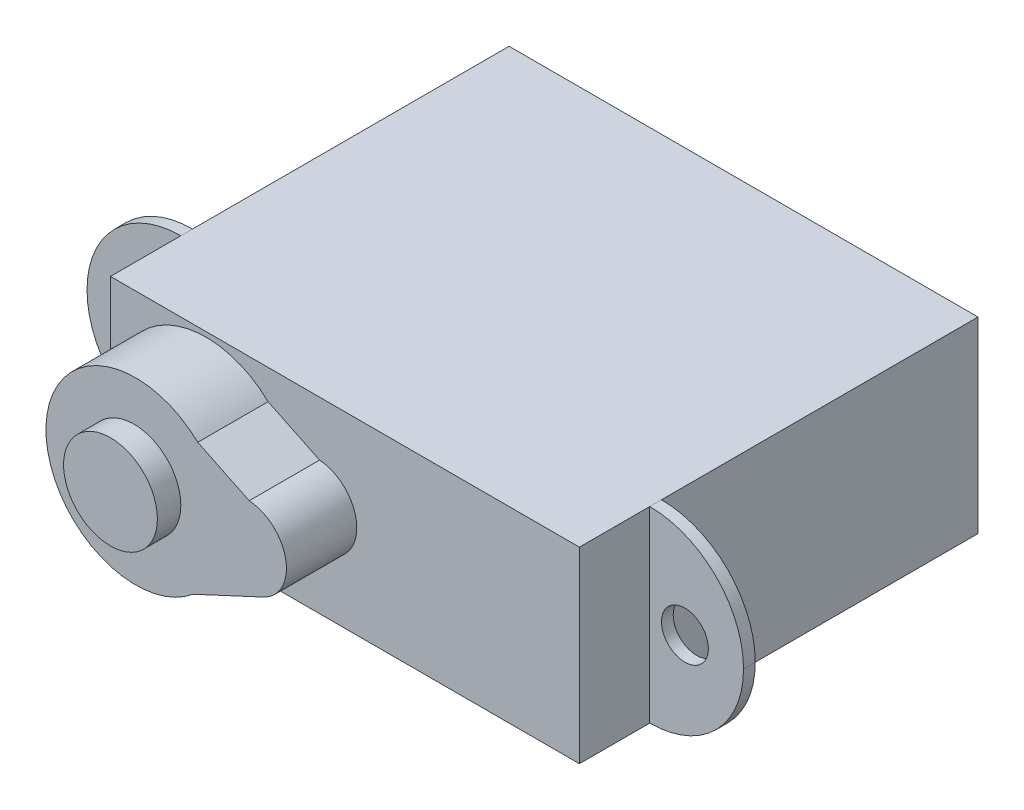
ISO-10303-21;
HEADER;
FILE_DESCRIPTION(('STEP AP214'),'2;1');
FILE_NAME('part.step','',(''),(''),'','','');
FILE_SCHEMA(('AUTOMOTIVE_DESIGN { 1 0 10303 214 1 1 1 1 }'));
ENDSEC;
DATA;
#1=APPLICATION_CONTEXT('core data for automotive mechanical design processes');
#2=APPLICATION_PROTOCOL_DEFINITION('international standard','automotive_design',2000,#1);
#3=PRODUCT_CONTEXT('',#1,'mechanical');
#4=PRODUCT('Part','Part','',(#3));
#5=PRODUCT_RELATED_PRODUCT_CATEGORY('part','',(#4));
#6=PRODUCT_DEFINITION_FORMATION('','',#4);
#7=PRODUCT_DEFINITION_CONTEXT('part definition',#1,'design');
#8=PRODUCT_DEFINITION('design','',#6,#7);
#9=PRODUCT_DEFINITION_SHAPE('','',#8);
#10=(LENGTH_UNIT() NAMED_UNIT(*) SI_UNIT(.MILLI.,.METRE.));
#11=(NAMED_UNIT(*) PLANE_ANGLE_UNIT() SI_UNIT($,.RADIAN.));
#12=(NAMED_UNIT(*) SI_UNIT($,.STERADIAN.) SOLID_ANGLE_UNIT());
#13=UNCERTAINTY_MEASURE_WITH_UNIT(LENGTH_MEASURE(1.E-05),#10,'distance_accuracy_value','');
#14=(GEOMETRIC_REPRESENTATION_CONTEXT(3) GLOBAL_UNCERTAINTY_ASSIGNED_CONTEXT((#13)) GLOBAL_UNIT_ASSIGNED_CONTEXT((#10,
#11,#12)) REPRESENTATION_CONTEXT('',''));
#15=CARTESIAN_POINT('',(0.,0.,0.));
#16=DIRECTION('',(0.,0.,1.));
#17=DIRECTION('',(1.,0.,0.));
#18=AXIS2_PLACEMENT_3D('',#15,#16,#17);
#19=CARTESIAN_POINT('',(-6.61728395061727,5.28395061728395,17.));
#20=DIRECTION('',(1.,0.,0.));
#21=DIRECTION('',(0.,0.,-1.));
#22=AXIS2_PLACEMENT_3D('',#19,#20,#21);
#23=PLANE('',#22);
#24=DIRECTION('',(0.,0.,-1.));
#25=VECTOR('',#24,1.);
#26=CARTESIAN_POINT('',(-6.61728395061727,5.28395061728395,17.));
#27=LINE('',#26,#25);
#28=CARTESIAN_POINT('',(-6.61728395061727,5.28395061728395,17.));
#29=VERTEX_POINT('',#28);
#30=CARTESIAN_POINT('',(-6.61728395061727,5.28395061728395,14.));
#31=VERTEX_POINT('',#30);
#32=EDGE_CURVE('E219',#29,#31,#27,.T.);
#33=ORIENTED_EDGE('',*,*,#32,.T.);
#34=DIRECTION('',(0.,-1.,0.));
#35=VECTOR('',#34,1.);
#36=CARTESIAN_POINT('',(-6.61728395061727,5.28395061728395,14.));
#37=LINE('',#36,#35);
#38=CARTESIAN_POINT('',(-6.61728395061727,-2.71604938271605,14.));
#39=VERTEX_POINT('',#38);
#40=EDGE_CURVE('E228',#31,#39,#37,.T.);
#41=ORIENTED_EDGE('',*,*,#40,.T.);
#42=DIRECTION('',(0.,0.,-1.));
#43=VECTOR('',#42,1.);
#44=CARTESIAN_POINT('',(-6.61728395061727,-2.71604938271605,17.));
#45=LINE('',#44,#43);
#46=CARTESIAN_POINT('',(-6.61728395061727,-2.71604938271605,17.));
#47=VERTEX_POINT('',#46);
#48=EDGE_CURVE('E240',#47,#39,#45,.T.);
#49=ORIENTED_EDGE('',*,*,#48,.F.);
#50=DIRECTION('',(0.,-1.,0.));
#51=VECTOR('',#50,1.);
#52=CARTESIAN_POINT('',(-6.61728395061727,5.28395061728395,17.));
#53=LINE('',#52,#51);
#54=EDGE_CURVE('E270',#29,#47,#53,.T.);
#55=ORIENTED_EDGE('',*,*,#54,.F.);
#56=EDGE_LOOP('',(#33,#41,#49,#55));
#57=FACE_BOUND('',#56,.T.);
#58=ADVANCED_FACE('F36',(#57),#23,.F.);
#59=CARTESIAN_POINT('',(13.3827160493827,5.28395061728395,17.));
#60=DIRECTION('',(-1.,0.,0.));
#61=DIRECTION('',(0.,0.,1.));
#62=AXIS2_PLACEMENT_3D('',#59,#60,#61);
#63=PLANE('',#62);
#64=DIRECTION('',(0.,0.,-1.));
#65=VECTOR('',#64,1.);
#66=CARTESIAN_POINT('',(13.3827160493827,-2.71604938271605,17.));
#67=LINE('',#66,#65);
#68=CARTESIAN_POINT('',(13.3827160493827,-2.71604938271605,17.));
#69=VERTEX_POINT('',#68);
#70=CARTESIAN_POINT('',(13.3827160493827,-2.71604938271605,14.));
#71=VERTEX_POINT('',#70);
#72=EDGE_CURVE('E170',#69,#71,#67,.T.);
#73=ORIENTED_EDGE('',*,*,#72,.T.);
#74=DIRECTION('',(0.,1.,0.));
#75=VECTOR('',#74,1.);
#76=CARTESIAN_POINT('',(13.3827160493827,5.28395061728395,14.));
#77=LINE('',#76,#75);
#78=CARTESIAN_POINT('',(13.3827160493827,5.28395061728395,14.));
#79=VERTEX_POINT('',#78);
#80=EDGE_CURVE('E225',#71,#79,#77,.T.);
#81=ORIENTED_EDGE('',*,*,#80,.T.);
#82=DIRECTION('',(0.,0.,-1.));
#83=VECTOR('',#82,1.);
#84=CARTESIAN_POINT('',(13.3827160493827,5.28395061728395,17.));
#85=LINE('',#84,#83);
#86=CARTESIAN_POINT('',(13.3827160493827,5.28395061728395,17.));
#87=VERTEX_POINT('',#86);
#88=EDGE_CURVE('E171',#87,#79,#85,.T.);
#89=ORIENTED_EDGE('',*,*,#88,.F.);
#90=DIRECTION('',(0.,1.,0.));
#91=VECTOR('',#90,1.);
#92=CARTESIAN_POINT('',(13.3827160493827,5.28395061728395,17.));
#93=LINE('',#92,#91);
#94=EDGE_CURVE('E275',#69,#87,#93,.T.);
#95=ORIENTED_EDGE('',*,*,#94,.F.);
#96=EDGE_LOOP('',(#73,#81,#89,#95));
#97=FACE_BOUND('',#96,.T.);
#98=ADVANCED_FACE('F310',(#97),#63,.F.);
#99=CARTESIAN_POINT('',(0.,0.,17.));
#100=DIRECTION('',(0.,0.,1.));
#101=DIRECTION('',(1.,0.,0.));
#102=AXIS2_PLACEMENT_3D('',#99,#100,#101);
#103=PLANE('',#102);
#104=ORIENTED_EDGE('',*,*,#54,.T.);
#105=DIRECTION('',(1.,0.,0.));
#106=VECTOR('',#105,1.);
#107=CARTESIAN_POINT('',(-6.61728395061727,-2.71604938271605,17.));
#108=LINE('',#107,#106);
#109=EDGE_CURVE('E273',#47,#69,#108,.T.);
#110=ORIENTED_EDGE('',*,*,#109,.T.);
#111=ORIENTED_EDGE('',*,*,#94,.T.);
#112=DIRECTION('',(-1.,0.,0.));
#113=VECTOR('',#112,1.);
#114=CARTESIAN_POINT('',(-6.61728395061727,5.28395061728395,17.));
#115=LINE('',#114,#113);
#116=EDGE_CURVE('E220',#87,#29,#115,.T.);
#117=ORIENTED_EDGE('',*,*,#116,.T.);
#118=EDGE_LOOP('',(#104,#110,#111,#117));
#119=FACE_BOUND('',#118,.T.);
#120=DIRECTION('',(0.906681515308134,0.421815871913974,0.));
#121=VECTOR('',#120,1.);
#122=CARTESIAN_POINT('',(2.89875783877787,-0.302449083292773,17.));
#123=LINE('',#122,#121);
#124=CARTESIAN_POINT('',(-0.0946737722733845,-1.69508469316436,17.));
#125=VERTEX_POINT('',#124);
#126=CARTESIAN_POINT('',(2.89875783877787,-0.302449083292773,17.));
#127=VERTEX_POINT('',#126);
#128=EDGE_CURVE('E254',#125,#127,#123,.T.);
#129=ORIENTED_EDGE('',*,*,#128,.F.);
#130=CARTESIAN_POINT('',(-2.54066331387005,1.25043792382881,17.));
#131=DIRECTION('',(0.,0.,1.));
#132=DIRECTION('',(1.,0.,0.));
#133=AXIS2_PLACEMENT_3D('',#130,#131,#132);
#134=CIRCLE('',#133,3.82870321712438);
#135=CARTESIAN_POINT('',(0.105430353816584,4.01759470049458,17.));
#136=VERTEX_POINT('',#135);
#137=EDGE_CURVE('E237',#136,#125,#134,.T.);
#138=ORIENTED_EDGE('',*,*,#137,.F.);
#139=DIRECTION('',(-0.900694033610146,0.434453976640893,0.));
#140=VECTOR('',#139,1.);
#141=CARTESIAN_POINT('',(0.105430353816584,4.01759470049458,17.));
#142=LINE('',#141,#140);
#143=CARTESIAN_POINT('',(2.30086226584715,2.95861785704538,17.));
#144=VERTEX_POINT('',#143);
#145=EDGE_CURVE('E245',#144,#136,#142,.T.);
#146=ORIENTED_EDGE('',*,*,#145,.F.);
#147=CARTESIAN_POINT('',(2.17630747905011,1.25043792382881,17.));
#148=DIRECTION('',(0.,0.,1.));
#149=DIRECTION('',(1.,0.,0.));
#150=AXIS2_PLACEMENT_3D('',#147,#148,#149);
#151=CIRCLE('',#150,1.71271497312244);
#152=EDGE_CURVE('E256',#127,#144,#151,.T.);
#153=ORIENTED_EDGE('',*,*,#152,.F.);
#154=EDGE_LOOP('',(#129,#138,#146,#153));
#155=FACE_BOUND('',#154,.T.);
#156=ADVANCED_FACE('F316',(#119,#155),#103,.T.);
#157=CARTESIAN_POINT('',(-6.61728395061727,-2.71604938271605,13.5));
#158=VERTEX_POINT('',#157);
#159=CARTESIAN_POINT('',(-6.61728395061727,-2.71604938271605,0.));
#160=VERTEX_POINT('',#159);
#161=EDGE_CURVE('E224',#158,#160,#45,.T.);
#162=ORIENTED_EDGE('',*,*,#161,.F.);
#163=DIRECTION('',(0.,1.,0.));
#164=VECTOR('',#163,1.);
#165=CARTESIAN_POINT('',(-6.61728395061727,5.28395061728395,13.5));
#166=LINE('',#165,#164);
#167=CARTESIAN_POINT('',(-6.61728395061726,5.28395061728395,13.5));
#168=VERTEX_POINT('',#167);
#169=EDGE_CURVE('E158',#158,#168,#166,.T.);
#170=ORIENTED_EDGE('',*,*,#169,.T.);
#171=CARTESIAN_POINT('',(-6.61728395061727,5.28395061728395,0.));
#172=VERTEX_POINT('',#171);
#173=EDGE_CURVE('E209',#168,#172,#27,.T.);
#174=ORIENTED_EDGE('',*,*,#173,.T.);
#175=DIRECTION('',(0.,-1.,0.));
#176=VECTOR('',#175,1.);
#177=CARTESIAN_POINT('',(-6.61728395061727,5.28395061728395,0.));
#178=LINE('',#177,#176);
#179=EDGE_CURVE('E269',#172,#160,#178,.T.);
#180=ORIENTED_EDGE('',*,*,#179,.T.);
#181=EDGE_LOOP('',(#162,#170,#174,#180));
#182=FACE_BOUND('',#181,.T.);
#183=ADVANCED_FACE('F223',(#182),#23,.F.);
#184=CARTESIAN_POINT('',(-6.61728395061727,-2.71604938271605,17.));
#185=DIRECTION('',(0.,1.,0.));
#186=DIRECTION('',(0.,0.,1.));
#187=AXIS2_PLACEMENT_3D('',#184,#185,#186);
#188=PLANE('',#187);
#189=CARTESIAN_POINT('',(13.3827160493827,-2.71604938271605,13.5));
#190=VERTEX_POINT('',#189);
#191=CARTESIAN_POINT('',(13.3827160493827,-2.71604938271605,0.));
#192=VERTEX_POINT('',#191);
#193=EDGE_CURVE('E155',#190,#192,#67,.T.);
#194=ORIENTED_EDGE('',*,*,#193,.F.);
#195=DIRECTION('',(0.,0.,1.));
#196=VECTOR('',#195,1.);
#197=CARTESIAN_POINT('',(13.3827160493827,-2.71604938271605,14.));
#198=LINE('',#197,#196);
#199=EDGE_CURVE('E165',#190,#71,#198,.T.);
#200=ORIENTED_EDGE('',*,*,#199,.T.);
#201=ORIENTED_EDGE('',*,*,#72,.F.);
#202=ORIENTED_EDGE('',*,*,#109,.F.);
#203=ORIENTED_EDGE('',*,*,#48,.T.);
#204=DIRECTION('',(0.,0.,1.));
#205=VECTOR('',#204,1.);
#206=CARTESIAN_POINT('',(-6.61728395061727,-2.71604938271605,17.));
#207=LINE('',#206,#205);
#208=EDGE_CURVE('E176',#39,#158,#207,.F.);
#209=ORIENTED_EDGE('',*,*,#208,.T.);
#210=ORIENTED_EDGE('',*,*,#161,.T.);
#211=DIRECTION('',(1.,0.,0.));
#212=VECTOR('',#211,1.);
#213=CARTESIAN_POINT('',(-6.61728395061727,-2.71604938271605,0.));
#214=LINE('',#213,#212);
#215=EDGE_CURVE('E168',#160,#192,#214,.T.);
#216=ORIENTED_EDGE('',*,*,#215,.T.);
#217=EDGE_LOOP('',(#194,#200,#201,#202,#203,#209,#210,#216));
#218=FACE_BOUND('',#217,.T.);
#219=ADVANCED_FACE('F163',(#218),#188,.F.);
#220=CARTESIAN_POINT('',(13.3827160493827,5.28395061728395,13.5));
#221=VERTEX_POINT('',#220);
#222=CARTESIAN_POINT('',(13.3827160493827,5.28395061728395,0.));
#223=VERTEX_POINT('',#222);
#224=EDGE_CURVE('E157',#221,#223,#85,.T.);
#225=ORIENTED_EDGE('',*,*,#224,.F.);
#226=DIRECTION('',(0.,-1.,0.));
#227=VECTOR('',#226,1.);
#228=CARTESIAN_POINT('',(13.3827160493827,5.28395061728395,13.5));
#229=LINE('',#228,#227);
#230=EDGE_CURVE('E141',#221,#190,#229,.T.);
#231=ORIENTED_EDGE('',*,*,#230,.T.);
#232=ORIENTED_EDGE('',*,*,#193,.T.);
#233=DIRECTION('',(0.,1.,0.));
#234=VECTOR('',#233,1.);
#235=CARTESIAN_POINT('',(13.3827160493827,5.28395061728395,0.));
#236=LINE('',#235,#234);
#237=EDGE_CURVE('E280',#192,#223,#236,.T.);
#238=ORIENTED_EDGE('',*,*,#237,.T.);
#239=EDGE_LOOP('',(#225,#231,#232,#238));
#240=FACE_BOUND('',#239,.T.);
#241=ADVANCED_FACE('F153',(#240),#63,.F.);
#242=CARTESIAN_POINT('',(-6.61728395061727,5.28395061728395,17.));
#243=DIRECTION('',(0.,-1.,0.));
#244=DIRECTION('',(0.,0.,-1.));
#245=AXIS2_PLACEMENT_3D('',#242,#243,#244);
#246=PLANE('',#245);
#247=ORIENTED_EDGE('',*,*,#88,.T.);
#248=DIRECTION('',(0.,0.,-1.));
#249=VECTOR('',#248,1.);
#250=CARTESIAN_POINT('',(13.3827160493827,5.28395061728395,13.5));
#251=LINE('',#250,#249);
#252=EDGE_CURVE('E187',#79,#221,#251,.T.);
#253=ORIENTED_EDGE('',*,*,#252,.T.);
#254=ORIENTED_EDGE('',*,*,#224,.T.);
#255=DIRECTION('',(-1.,0.,0.));
#256=VECTOR('',#255,1.);
#257=CARTESIAN_POINT('',(-6.61728395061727,5.28395061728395,0.));
#258=LINE('',#257,#256);
#259=EDGE_CURVE('E215',#223,#172,#258,.T.);
#260=ORIENTED_EDGE('',*,*,#259,.T.);
#261=ORIENTED_EDGE('',*,*,#173,.F.);
#262=DIRECTION('',(0.,0.,-1.));
#263=VECTOR('',#262,1.);
#264=CARTESIAN_POINT('',(-6.61728395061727,5.28395061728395,17.));
#265=LINE('',#264,#263);
#266=EDGE_CURVE('E149',#168,#31,#265,.F.);
#267=ORIENTED_EDGE('',*,*,#266,.T.);
#268=ORIENTED_EDGE('',*,*,#32,.F.);
#269=ORIENTED_EDGE('',*,*,#116,.F.);
#270=EDGE_LOOP('',(#247,#253,#254,#260,#261,#267,#268,#269));
#271=FACE_BOUND('',#270,.T.);
#272=ADVANCED_FACE('F211',(#271),#246,.F.);
#273=CARTESIAN_POINT('',(0.,0.,0.));
#274=DIRECTION('',(0.,0.,1.));
#275=DIRECTION('',(1.,0.,0.));
#276=AXIS2_PLACEMENT_3D('',#273,#274,#275);
#277=PLANE('',#276);
#278=ORIENTED_EDGE('',*,*,#179,.F.);
#279=ORIENTED_EDGE('',*,*,#259,.F.);
#280=ORIENTED_EDGE('',*,*,#237,.F.);
#281=ORIENTED_EDGE('',*,*,#215,.F.);
#282=EDGE_LOOP('',(#278,#279,#280,#281));
#283=FACE_BOUND('',#282,.T.);
#284=ADVANCED_FACE('F335',(#283),#277,.F.);
#285=CARTESIAN_POINT('',(-2.54066331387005,1.25043792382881,20.));
#286=DIRECTION('',(0.,0.,-1.));
#287=DIRECTION('',(-1.,0.,0.));
#288=AXIS2_PLACEMENT_3D('',#285,#286,#287);
#289=CYLINDRICAL_SURFACE('',#288,3.82870321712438);
#290=ORIENTED_EDGE('',*,*,#137,.T.);
#291=DIRECTION('',(0.,0.,-1.));
#292=VECTOR('',#291,1.);
#293=CARTESIAN_POINT('',(-0.0946737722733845,-1.69508469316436,20.));
#294=LINE('',#293,#292);
#295=CARTESIAN_POINT('',(-0.0946737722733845,-1.69508469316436,20.));
#296=VERTEX_POINT('',#295);
#297=EDGE_CURVE('E267',#296,#125,#294,.T.);
#298=ORIENTED_EDGE('',*,*,#297,.F.);
#299=CARTESIAN_POINT('',(-2.54066331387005,1.25043792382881,20.));
#300=DIRECTION('',(0.,0.,1.));
#301=DIRECTION('',(1.,0.,0.));
#302=AXIS2_PLACEMENT_3D('',#299,#300,#301);
#303=CIRCLE('',#302,3.82870321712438);
#304=CARTESIAN_POINT('',(0.105430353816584,4.01759470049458,20.));
#305=VERTEX_POINT('',#304);
#306=EDGE_CURVE('E241',#305,#296,#303,.T.);
#307=ORIENTED_EDGE('',*,*,#306,.F.);
#308=DIRECTION('',(0.,0.,-1.));
#309=VECTOR('',#308,1.);
#310=CARTESIAN_POINT('',(0.105430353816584,4.01759470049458,20.));
#311=LINE('',#310,#309);
#312=EDGE_CURVE('E251',#305,#136,#311,.T.);
#313=ORIENTED_EDGE('',*,*,#312,.T.);
#314=EDGE_LOOP('',(#290,#298,#307,#313));
#315=FACE_BOUND('',#314,.T.);
#316=ADVANCED_FACE('F333',(#315),#289,.T.);
#317=CARTESIAN_POINT('',(2.89875783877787,-0.302449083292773,20.));
#318=DIRECTION('',(-0.421815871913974,0.906681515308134,0.));
#319=DIRECTION('',(-0.906681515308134,-0.421815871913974,0.));
#320=AXIS2_PLACEMENT_3D('',#317,#318,#319);
#321=PLANE('',#320);
#322=ORIENTED_EDGE('',*,*,#128,.T.);
#323=DIRECTION('',(0.,0.,-1.));
#324=VECTOR('',#323,1.);
#325=CARTESIAN_POINT('',(2.89875783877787,-0.302449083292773,20.));
#326=LINE('',#325,#324);
#327=CARTESIAN_POINT('',(2.89875783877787,-0.302449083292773,20.));
#328=VERTEX_POINT('',#327);
#329=EDGE_CURVE('E264',#328,#127,#326,.T.);
#330=ORIENTED_EDGE('',*,*,#329,.F.);
#331=DIRECTION('',(0.906681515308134,0.421815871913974,0.));
#332=VECTOR('',#331,1.);
#333=CARTESIAN_POINT('',(2.89875783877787,-0.302449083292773,20.));
#334=LINE('',#333,#332);
#335=EDGE_CURVE('E244',#296,#328,#334,.T.);
#336=ORIENTED_EDGE('',*,*,#335,.F.);
#337=ORIENTED_EDGE('',*,*,#297,.T.);
#338=EDGE_LOOP('',(#322,#330,#336,#337));
#339=FACE_BOUND('',#338,.T.);
#340=ADVANCED_FACE('F361',(#339),#321,.F.);
#341=CARTESIAN_POINT('',(2.17630747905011,1.25043792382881,20.));
#342=DIRECTION('',(0.,0.,-1.));
#343=DIRECTION('',(-1.,0.,0.));
#344=AXIS2_PLACEMENT_3D('',#341,#342,#343);
#345=CYLINDRICAL_SURFACE('',#344,1.71271497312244);
#346=ORIENTED_EDGE('',*,*,#152,.T.);
#347=DIRECTION('',(0.,0.,-1.));
#348=VECTOR('',#347,1.);
#349=CARTESIAN_POINT('',(2.30086226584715,2.95861785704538,20.));
#350=LINE('',#349,#348);
#351=CARTESIAN_POINT('',(2.30086226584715,2.95861785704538,20.));
#352=VERTEX_POINT('',#351);
#353=EDGE_CURVE('E262',#352,#144,#350,.T.);
#354=ORIENTED_EDGE('',*,*,#353,.F.);
#355=CARTESIAN_POINT('',(2.17630747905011,1.25043792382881,20.));
#356=DIRECTION('',(0.,0.,1.));
#357=DIRECTION('',(1.,0.,0.));
#358=AXIS2_PLACEMENT_3D('',#355,#356,#357);
#359=CIRCLE('',#358,1.71271497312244);
#360=EDGE_CURVE('E247',#328,#352,#359,.T.);
#361=ORIENTED_EDGE('',*,*,#360,.F.);
#362=ORIENTED_EDGE('',*,*,#329,.T.);
#363=EDGE_LOOP('',(#346,#354,#361,#362));
#364=FACE_BOUND('',#363,.T.);
#365=ADVANCED_FACE('F368',(#364),#345,.T.);
#366=CARTESIAN_POINT('',(0.105430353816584,4.01759470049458,20.));
#367=DIRECTION('',(-0.434453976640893,-0.900694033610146,0.));
#368=DIRECTION('',(0.900694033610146,-0.434453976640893,0.));
#369=AXIS2_PLACEMENT_3D('',#366,#367,#368);
#370=PLANE('',#369);
#371=ORIENTED_EDGE('',*,*,#145,.T.);
#372=ORIENTED_EDGE('',*,*,#312,.F.);
#373=DIRECTION('',(-0.900694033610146,0.434453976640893,0.));
#374=VECTOR('',#373,1.);
#375=CARTESIAN_POINT('',(0.105430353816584,4.01759470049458,20.));
#376=LINE('',#375,#374);
#377=EDGE_CURVE('E249',#352,#305,#376,.T.);
#378=ORIENTED_EDGE('',*,*,#377,.F.);
#379=ORIENTED_EDGE('',*,*,#353,.T.);
#380=EDGE_LOOP('',(#371,#372,#378,#379));
#381=FACE_BOUND('',#380,.T.);
#382=ADVANCED_FACE('F375',(#381),#370,.F.);
#383=CARTESIAN_POINT('',(-2.54066331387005,1.25043792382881,20.));
#384=DIRECTION('',(0.,0.,1.));
#385=DIRECTION('',(1.,0.,0.));
#386=AXIS2_PLACEMENT_3D('',#383,#384,#385);
#387=PLANE('',#386);
#388=CARTESIAN_POINT('',(-2.61728395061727,1.32778863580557,20.));
#389=DIRECTION('',(0.,0.,1.));
#390=DIRECTION('',(1.,0.,0.));
#391=AXIS2_PLACEMENT_3D('',#388,#389,#390);
#392=CIRCLE('',#391,2.);
#393=CARTESIAN_POINT('',(-0.61728395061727,1.32778863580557,20.));
#394=VERTEX_POINT('',#393);
#395=EDGE_CURVE('E180',#394,#394,#392,.T.);
#396=ORIENTED_EDGE('',*,*,#395,.F.);
#397=EDGE_LOOP('',(#396));
#398=FACE_BOUND('',#397,.T.);
#399=ORIENTED_EDGE('',*,*,#306,.T.);
#400=ORIENTED_EDGE('',*,*,#335,.T.);
#401=ORIENTED_EDGE('',*,*,#360,.T.);
#402=ORIENTED_EDGE('',*,*,#377,.T.);
#403=EDGE_LOOP('',(#399,#400,#401,#402));
#404=FACE_BOUND('',#403,.T.);
#405=ADVANCED_FACE('F383',(#398,#404),#387,.T.);
#406=CARTESIAN_POINT('',(-2.61728395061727,1.32778863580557,21.));
#407=DIRECTION('',(0.,0.,-1.));
#408=DIRECTION('',(-1.,0.,0.));
#409=AXIS2_PLACEMENT_3D('',#406,#407,#408);
#410=CYLINDRICAL_SURFACE('',#409,2.);
#411=CARTESIAN_POINT('',(-2.61728395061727,1.32778863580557,21.));
#412=DIRECTION('',(0.,0.,1.));
#413=DIRECTION('',(1.,0.,0.));
#414=AXIS2_PLACEMENT_3D('',#411,#412,#413);
#415=CIRCLE('',#414,2.);
#416=CARTESIAN_POINT('',(-0.61728395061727,1.32778863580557,21.));
#417=VERTEX_POINT('',#416);
#418=EDGE_CURVE('E234',#417,#417,#415,.T.);
#419=ORIENTED_EDGE('',*,*,#418,.F.);
#420=EDGE_LOOP('',(#419));
#421=FACE_BOUND('',#420,.T.);
#422=ORIENTED_EDGE('',*,*,#395,.T.);
#423=EDGE_LOOP('',(#422));
#424=FACE_BOUND('',#423,.T.);
#425=ADVANCED_FACE('F391',(#421,#424),#410,.T.);
#426=CARTESIAN_POINT('',(-2.61728395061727,1.32778863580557,21.));
#427=DIRECTION('',(0.,0.,1.));
#428=DIRECTION('',(1.,0.,0.));
#429=AXIS2_PLACEMENT_3D('',#426,#427,#428);
#430=PLANE('',#429);
#431=ORIENTED_EDGE('',*,*,#418,.T.);
#432=EDGE_LOOP('',(#431));
#433=FACE_BOUND('',#432,.T.);
#434=ADVANCED_FACE('F399',(#433),#430,.T.);
#435=CARTESIAN_POINT('',(17.3827160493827,5.28395061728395,13.5));
#436=DIRECTION('',(0.,0.,-1.));
#437=DIRECTION('',(-1.,0.,0.));
#438=AXIS2_PLACEMENT_3D('',#435,#436,#437);
#439=PLANE('',#438);
#440=CARTESIAN_POINT('',(14.8827160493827,1.28395061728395,13.5));
#441=DIRECTION('',(0.,0.,-1.));
#442=DIRECTION('',(-1.,0.,0.));
#443=AXIS2_PLACEMENT_3D('',#440,#441,#442);
#444=CIRCLE('',#443,1.);
#445=CARTESIAN_POINT('',(13.8827160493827,1.28395061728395,13.5));
#446=VERTEX_POINT('',#445);
#447=EDGE_CURVE('E159',#446,#446,#444,.T.);
#448=ORIENTED_EDGE('',*,*,#447,.F.);
#449=EDGE_LOOP('',(#448));
#450=FACE_BOUND('',#449,.T.);
#451=CARTESIAN_POINT('',(13.3827160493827,1.28395061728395,13.5));
#452=DIRECTION('',(0.,0.,-1.));
#453=DIRECTION('',(-1.,0.,0.));
#454=AXIS2_PLACEMENT_3D('',#451,#452,#453);
#455=CIRCLE('',#454,4.);
#456=CARTESIAN_POINT('',(17.3827160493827,1.28395061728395,13.5));
#457=VERTEX_POINT('',#456);
#458=EDGE_CURVE('E144',#221,#457,#455,.T.);
#459=ORIENTED_EDGE('',*,*,#458,.T.);
#460=CARTESIAN_POINT('',(13.3827160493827,1.28395061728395,13.5));
#461=DIRECTION('',(0.,0.,-1.));
#462=DIRECTION('',(-1.,0.,0.));
#463=AXIS2_PLACEMENT_3D('',#460,#461,#462);
#464=CIRCLE('',#463,4.);
#465=EDGE_CURVE('E138',#457,#190,#464,.T.);
#466=ORIENTED_EDGE('',*,*,#465,.T.);
#467=ORIENTED_EDGE('',*,*,#230,.F.);
#468=EDGE_LOOP('',(#459,#466,#467));
#469=FACE_BOUND('',#468,.T.);
#470=ADVANCED_FACE('F140',(#450,#469),#439,.T.);
#471=CARTESIAN_POINT('',(17.3827160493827,5.28395061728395,14.));
#472=DIRECTION('',(0.,0.,1.));
#473=DIRECTION('',(1.,0.,0.));
#474=AXIS2_PLACEMENT_3D('',#471,#472,#473);
#475=PLANE('',#474);
#476=CARTESIAN_POINT('',(14.8827160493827,1.28395061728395,14.));
#477=DIRECTION('',(0.,0.,1.));
#478=DIRECTION('',(1.,0.,0.));
#479=AXIS2_PLACEMENT_3D('',#476,#477,#478);
#480=CIRCLE('',#479,1.);
#481=CARTESIAN_POINT('',(15.8827160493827,1.28395061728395,14.));
#482=VERTEX_POINT('',#481);
#483=EDGE_CURVE('E193',#482,#482,#480,.T.);
#484=ORIENTED_EDGE('',*,*,#483,.F.);
#485=EDGE_LOOP('',(#484));
#486=FACE_BOUND('',#485,.T.);
#487=ORIENTED_EDGE('',*,*,#80,.F.);
#488=CARTESIAN_POINT('',(13.3827160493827,1.28395061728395,14.));
#489=DIRECTION('',(0.,0.,1.));
#490=DIRECTION('',(1.,0.,0.));
#491=AXIS2_PLACEMENT_3D('',#488,#489,#490);
#492=CIRCLE('',#491,4.);
#493=CARTESIAN_POINT('',(17.3827160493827,1.28395061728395,14.));
#494=VERTEX_POINT('',#493);
#495=EDGE_CURVE('E174',#71,#494,#492,.T.);
#496=ORIENTED_EDGE('',*,*,#495,.T.);
#497=CARTESIAN_POINT('',(13.3827160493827,1.28395061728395,14.));
#498=DIRECTION('',(0.,0.,1.));
#499=DIRECTION('',(1.,0.,0.));
#500=AXIS2_PLACEMENT_3D('',#497,#498,#499);
#501=CIRCLE('',#500,4.);
#502=EDGE_CURVE('E175',#494,#79,#501,.T.);
#503=ORIENTED_EDGE('',*,*,#502,.T.);
#504=EDGE_LOOP('',(#487,#496,#503));
#505=FACE_BOUND('',#504,.T.);
#506=ADVANCED_FACE('F299',(#486,#505),#475,.T.);
#507=CARTESIAN_POINT('',(-8.11728395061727,1.28395061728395,14.));
#508=DIRECTION('',(0.,0.,1.));
#509=DIRECTION('',(1.,0.,0.));
#510=AXIS2_PLACEMENT_3D('',#507,#508,#509);
#511=CIRCLE('',#510,1.);
#512=CARTESIAN_POINT('',(-7.11728395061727,1.28395061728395,14.));
#513=VERTEX_POINT('',#512);
#514=EDGE_CURVE('E195',#513,#513,#511,.T.);
#515=ORIENTED_EDGE('',*,*,#514,.F.);
#516=EDGE_LOOP('',(#515));
#517=FACE_BOUND('',#516,.T.);
#518=CARTESIAN_POINT('',(-6.61728395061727,1.28395061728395,14.));
#519=DIRECTION('',(0.,0.,1.));
#520=DIRECTION('',(1.,0.,0.));
#521=AXIS2_PLACEMENT_3D('',#518,#519,#520);
#522=CIRCLE('',#521,4.);
#523=CARTESIAN_POINT('',(-10.6172839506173,1.28395061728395,14.));
#524=VERTEX_POINT('',#523);
#525=EDGE_CURVE('E59',#31,#524,#522,.T.);
#526=ORIENTED_EDGE('',*,*,#525,.T.);
#527=CARTESIAN_POINT('',(-6.61728395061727,1.28395061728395,14.));
#528=DIRECTION('',(0.,0.,1.));
#529=DIRECTION('',(1.,0.,0.));
#530=AXIS2_PLACEMENT_3D('',#527,#528,#529);
#531=CIRCLE('',#530,4.);
#532=EDGE_CURVE('E190',#524,#39,#531,.T.);
#533=ORIENTED_EDGE('',*,*,#532,.T.);
#534=ORIENTED_EDGE('',*,*,#40,.F.);
#535=EDGE_LOOP('',(#526,#533,#534));
#536=FACE_BOUND('',#535,.T.);
#537=ADVANCED_FACE('F297',(#517,#536),#475,.T.);
#538=CARTESIAN_POINT('',(-8.11728395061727,1.28395061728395,13.5));
#539=DIRECTION('',(0.,0.,-1.));
#540=DIRECTION('',(-1.,0.,0.));
#541=AXIS2_PLACEMENT_3D('',#538,#539,#540);
#542=CIRCLE('',#541,1.);
#543=CARTESIAN_POINT('',(-9.11728395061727,1.28395061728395,13.5));
#544=VERTEX_POINT('',#543);
#545=EDGE_CURVE('E286',#544,#544,#542,.T.);
#546=ORIENTED_EDGE('',*,*,#545,.F.);
#547=EDGE_LOOP('',(#546));
#548=FACE_BOUND('',#547,.T.);
#549=ORIENTED_EDGE('',*,*,#169,.F.);
#550=CARTESIAN_POINT('',(-6.61728395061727,1.28395061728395,13.5));
#551=DIRECTION('',(0.,0.,-1.));
#552=DIRECTION('',(-1.,0.,0.));
#553=AXIS2_PLACEMENT_3D('',#550,#551,#552);
#554=CIRCLE('',#553,4.);
#555=CARTESIAN_POINT('',(-10.6172839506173,1.28395061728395,13.5));
#556=VERTEX_POINT('',#555);
#557=EDGE_CURVE('E11',#158,#556,#554,.T.);
#558=ORIENTED_EDGE('',*,*,#557,.T.);
#559=CARTESIAN_POINT('',(-6.61728395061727,1.28395061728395,13.5));
#560=DIRECTION('',(0.,0.,-1.));
#561=DIRECTION('',(-1.,0.,0.));
#562=AXIS2_PLACEMENT_3D('',#559,#560,#561);
#563=CIRCLE('',#562,4.);
#564=EDGE_CURVE('E45',#556,#168,#563,.T.);
#565=ORIENTED_EDGE('',*,*,#564,.T.);
#566=EDGE_LOOP('',(#549,#558,#565));
#567=FACE_BOUND('',#566,.T.);
#568=ADVANCED_FACE('F205',(#548,#567),#439,.T.);
#569=CARTESIAN_POINT('',(-8.11728395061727,1.28395061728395,10.));
#570=DIRECTION('',(0.,0.,1.));
#571=DIRECTION('',(1.,0.,0.));
#572=AXIS2_PLACEMENT_3D('',#569,#570,#571);
#573=CYLINDRICAL_SURFACE('',#572,1.);
#574=ORIENTED_EDGE('',*,*,#545,.T.);
#575=EDGE_LOOP('',(#574));
#576=FACE_BOUND('',#575,.T.);
#577=ORIENTED_EDGE('',*,*,#514,.T.);
#578=EDGE_LOOP('',(#577));
#579=FACE_BOUND('',#578,.T.);
#580=ADVANCED_FACE('F295',(#576,#579),#573,.F.);
#581=CARTESIAN_POINT('',(14.8827160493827,1.28395061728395,10.));
#582=DIRECTION('',(0.,0.,1.));
#583=DIRECTION('',(1.,0.,0.));
#584=AXIS2_PLACEMENT_3D('',#581,#582,#583);
#585=CYLINDRICAL_SURFACE('',#584,1.);
#586=ORIENTED_EDGE('',*,*,#447,.T.);
#587=EDGE_LOOP('',(#586));
#588=FACE_BOUND('',#587,.T.);
#589=ORIENTED_EDGE('',*,*,#483,.T.);
#590=EDGE_LOOP('',(#589));
#591=FACE_BOUND('',#590,.T.);
#592=ADVANCED_FACE('F439',(#588,#591),#585,.F.);
#593=CARTESIAN_POINT('',(13.3827160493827,1.28395061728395,17.));
#594=DIRECTION('',(0.,0.,1.));
#595=DIRECTION('',(1.,0.,0.));
#596=AXIS2_PLACEMENT_3D('',#593,#594,#595);
#597=CYLINDRICAL_SURFACE('',#596,4.);
#598=DIRECTION('',(0.,0.,-1.));
#599=VECTOR('',#598,1.);
#600=CARTESIAN_POINT('',(17.3827160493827,1.28395061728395,14.));
#601=LINE('',#600,#599);
#602=EDGE_CURVE('E192',#457,#494,#601,.F.);
#603=ORIENTED_EDGE('',*,*,#602,.F.);
#604=ORIENTED_EDGE('',*,*,#458,.F.);
#605=ORIENTED_EDGE('',*,*,#252,.F.);
#606=ORIENTED_EDGE('',*,*,#502,.F.);
#607=EDGE_LOOP('',(#603,#604,#605,#606));
#608=FACE_BOUND('',#607,.T.);
#609=ADVANCED_FACE('F434',(#608),#597,.T.);
#610=CARTESIAN_POINT('',(13.3827160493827,1.28395061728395,17.));
#611=DIRECTION('',(0.,0.,-1.));
#612=DIRECTION('',(-1.,0.,0.));
#613=AXIS2_PLACEMENT_3D('',#610,#611,#612);
#614=CYLINDRICAL_SURFACE('',#613,4.);
#615=ORIENTED_EDGE('',*,*,#465,.F.);
#616=ORIENTED_EDGE('',*,*,#602,.T.);
#617=ORIENTED_EDGE('',*,*,#495,.F.);
#618=ORIENTED_EDGE('',*,*,#199,.F.);
#619=EDGE_LOOP('',(#615,#616,#617,#618));
#620=FACE_BOUND('',#619,.T.);
#621=ADVANCED_FACE('F173',(#620),#614,.T.);
#622=CARTESIAN_POINT('',(-6.61728395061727,1.28395061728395,0.));
#623=DIRECTION('',(0.,0.,-1.));
#624=DIRECTION('',(-1.,0.,0.));
#625=AXIS2_PLACEMENT_3D('',#622,#623,#624);
#626=CYLINDRICAL_SURFACE('',#625,4.);
#627=ORIENTED_EDGE('',*,*,#266,.F.);
#628=ORIENTED_EDGE('',*,*,#564,.F.);
#629=DIRECTION('',(0.,0.,-1.));
#630=VECTOR('',#629,1.);
#631=CARTESIAN_POINT('',(-10.6172839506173,1.28395061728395,0.));
#632=LINE('',#631,#630);
#633=EDGE_CURVE('E40',#524,#556,#632,.T.);
#634=ORIENTED_EDGE('',*,*,#633,.F.);
#635=ORIENTED_EDGE('',*,*,#525,.F.);
#636=EDGE_LOOP('',(#627,#628,#634,#635));
#637=FACE_BOUND('',#636,.T.);
#638=ADVANCED_FACE('F38',(#637),#626,.T.);
#639=CARTESIAN_POINT('',(-6.61728395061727,1.28395061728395,0.));
#640=DIRECTION('',(0.,0.,1.));
#641=DIRECTION('',(1.,0.,0.));
#642=AXIS2_PLACEMENT_3D('',#639,#640,#641);
#643=CYLINDRICAL_SURFACE('',#642,4.);
#644=ORIENTED_EDGE('',*,*,#557,.F.);
#645=ORIENTED_EDGE('',*,*,#208,.F.);
#646=ORIENTED_EDGE('',*,*,#532,.F.);
#647=ORIENTED_EDGE('',*,*,#633,.T.);
#648=EDGE_LOOP('',(#644,#645,#646,#647));
#649=FACE_BOUND('',#648,.T.);
#650=ADVANCED_FACE('F200',(#649),#643,.T.);
#651=CLOSED_SHELL('',(#58,#98,#156,#183,#219,#241,#272,#284,#316,#340,#365,#382,#405,#425,#434,
#470,#506,#537,#568,#580,#592,#609,#621,#638,#650));
#652=MANIFOLD_SOLID_BREP('B2',#651);
#653=ADVANCED_BREP_SHAPE_REPRESENTATION('',(#18,#652),#14);
#654=SHAPE_DEFINITION_REPRESENTATION(#9,#653);
ENDSEC;
END-ISO-10303-21;
